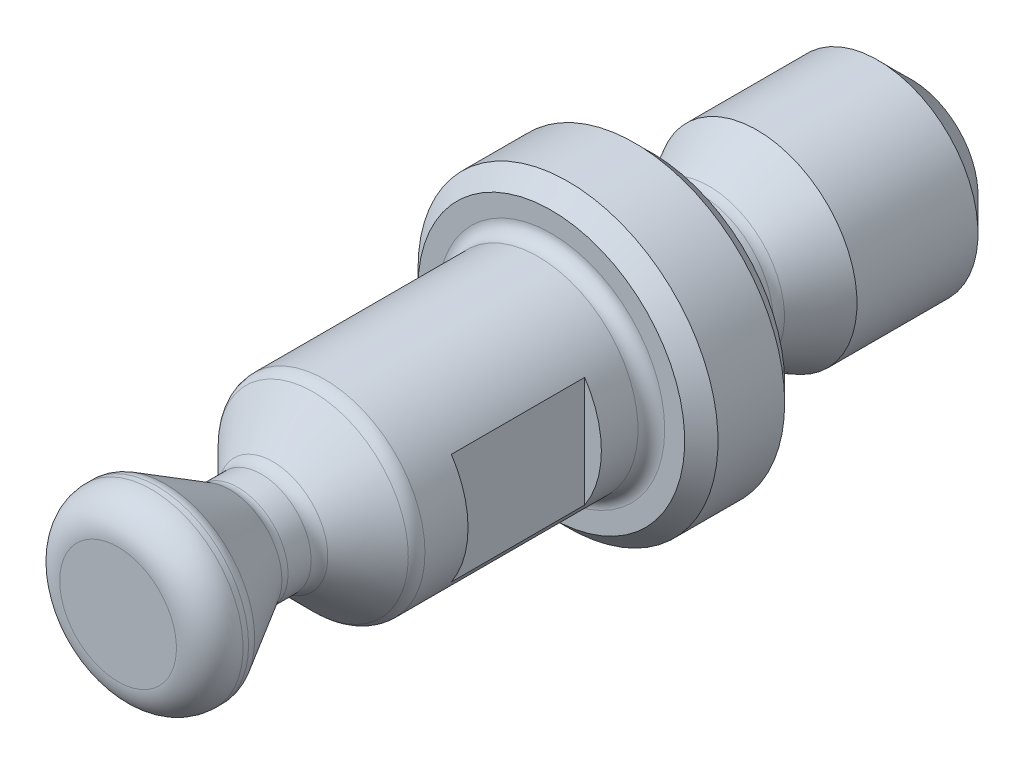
ISO-10303-21;
HEADER;
FILE_DESCRIPTION(('STEP AP214'),'2;1');
FILE_NAME('part.step','',(''),(''),'','','');
FILE_SCHEMA(('AUTOMOTIVE_DESIGN { 1 0 10303 214 1 1 1 1 }'));
ENDSEC;
DATA;
#1=APPLICATION_CONTEXT('core data for automotive mechanical design processes');
#2=APPLICATION_PROTOCOL_DEFINITION('international standard','automotive_design',2000,#1);
#3=PRODUCT_CONTEXT('',#1,'mechanical');
#4=PRODUCT('Part','Part','',(#3));
#5=PRODUCT_RELATED_PRODUCT_CATEGORY('part','',(#4));
#6=PRODUCT_DEFINITION_FORMATION('','',#4);
#7=PRODUCT_DEFINITION_CONTEXT('part definition',#1,'design');
#8=PRODUCT_DEFINITION('design','',#6,#7);
#9=PRODUCT_DEFINITION_SHAPE('','',#8);
#10=(LENGTH_UNIT() NAMED_UNIT(*) SI_UNIT(.MILLI.,.METRE.));
#11=(NAMED_UNIT(*) PLANE_ANGLE_UNIT() SI_UNIT($,.RADIAN.));
#12=(NAMED_UNIT(*) SI_UNIT($,.STERADIAN.) SOLID_ANGLE_UNIT());
#13=UNCERTAINTY_MEASURE_WITH_UNIT(LENGTH_MEASURE(1.E-05),#10,'distance_accuracy_value','');
#14=(GEOMETRIC_REPRESENTATION_CONTEXT(3) GLOBAL_UNCERTAINTY_ASSIGNED_CONTEXT((#13)) GLOBAL_UNIT_ASSIGNED_CONTEXT((#10,
#11,#12)) REPRESENTATION_CONTEXT('',''));
#15=CARTESIAN_POINT('',(0.,0.,0.));
#16=DIRECTION('',(0.,0.,1.));
#17=DIRECTION('',(1.,0.,0.));
#18=AXIS2_PLACEMENT_3D('',#15,#16,#17);
#19=CARTESIAN_POINT('',(0.,0.,-7.8));
#20=DIRECTION('',(0.,0.,1.));
#21=DIRECTION('',(1.,0.,0.));
#22=AXIS2_PLACEMENT_3D('',#19,#20,#21);
#23=PLANE('',#22);
#24=CARTESIAN_POINT('',(0.,0.,-7.8));
#25=DIRECTION('',(0.,0.,-1.));
#26=DIRECTION('',(-1.,0.,0.));
#27=AXIS2_PLACEMENT_3D('',#24,#25,#26);
#28=CIRCLE('',#27,2.);
#29=CARTESIAN_POINT('',(-1.99999999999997,0.,-7.80000000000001));
#30=VERTEX_POINT('',#29);
#31=EDGE_CURVE('E151',#30,#30,#28,.T.);
#32=ORIENTED_EDGE('',*,*,#31,.T.);
#33=EDGE_LOOP('',(#32));
#34=FACE_BOUND('',#33,.T.);
#35=ADVANCED_FACE('F14',(#34),#23,.F.);
#36=CARTESIAN_POINT('',(0.,0.,-6.8));
#37=DIRECTION('',(0.,0.,1.));
#38=DIRECTION('',(1.,0.,0.));
#39=AXIS2_PLACEMENT_3D('',#36,#37,#38);
#40=CONICAL_SURFACE('',#39,3.,0.785398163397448);
#41=ORIENTED_EDGE('',*,*,#31,.F.);
#42=EDGE_LOOP('',(#41));
#43=FACE_BOUND('',#42,.T.);
#44=CARTESIAN_POINT('',(0.,0.,-6.8));
#45=DIRECTION('',(0.,0.,-1.));
#46=DIRECTION('',(-1.,0.,0.));
#47=AXIS2_PLACEMENT_3D('',#44,#45,#46);
#48=CIRCLE('',#47,3.);
#49=CARTESIAN_POINT('',(-2.99999999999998,0.,-6.80000000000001));
#50=VERTEX_POINT('',#49);
#51=EDGE_CURVE('E144',#50,#50,#48,.T.);
#52=ORIENTED_EDGE('',*,*,#51,.T.);
#53=EDGE_LOOP('',(#52));
#54=FACE_BOUND('',#53,.T.);
#55=ADVANCED_FACE('F207',(#43,#54),#40,.T.);
#56=CARTESIAN_POINT('',(1.602589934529E-13,0.,-45.9));
#57=DIRECTION('',(0.,0.,-1.));
#58=DIRECTION('',(-1.,0.,0.));
#59=AXIS2_PLACEMENT_3D('',#56,#57,#58);
#60=CYLINDRICAL_SURFACE('',#59,3.);
#61=ORIENTED_EDGE('',*,*,#51,.F.);
#62=EDGE_LOOP('',(#61));
#63=FACE_BOUND('',#62,.T.);
#64=CARTESIAN_POINT('',(0.,0.,-3.17008840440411));
#65=DIRECTION('',(0.,0.,-1.));
#66=DIRECTION('',(-1.,0.,0.));
#67=AXIS2_PLACEMENT_3D('',#64,#65,#66);
#68=CIRCLE('',#67,3.);
#69=CARTESIAN_POINT('',(-2.99999999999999,0.,-3.17008840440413));
#70=VERTEX_POINT('',#69);
#71=EDGE_CURVE('E141',#70,#70,#68,.T.);
#72=ORIENTED_EDGE('',*,*,#71,.T.);
#73=EDGE_LOOP('',(#72));
#74=FACE_BOUND('',#73,.T.);
#75=ADVANCED_FACE('F213',(#63,#74),#60,.T.);
#76=CARTESIAN_POINT('',(0.,0.,-1.6));
#77=DIRECTION('',(0.,0.,-1.));
#78=DIRECTION('',(-1.,0.,0.));
#79=AXIS2_PLACEMENT_3D('',#76,#77,#78);
#80=CONICAL_SURFACE('',#79,2.2,0.471238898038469);
#81=CARTESIAN_POINT('',(0.,0.,-1.72834704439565));
#82=DIRECTION('',(0.,0.,-1.));
#83=DIRECTION('',(-1.,0.,0.));
#84=AXIS2_PLACEMENT_3D('',#81,#82,#83);
#85=CIRCLE('',#84,2.26539608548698);
#86=CARTESIAN_POINT('',(-2.26539608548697,0.,-1.72834704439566));
#87=VERTEX_POINT('',#86);
#88=EDGE_CURVE('E184',#87,#87,#85,.T.);
#89=ORIENTED_EDGE('',*,*,#88,.T.);
#90=EDGE_LOOP('',(#89));
#91=FACE_BOUND('',#90,.T.);
#92=ORIENTED_EDGE('',*,*,#71,.F.);
#93=EDGE_LOOP('',(#92));
#94=FACE_BOUND('',#93,.T.);
#95=ADVANCED_FACE('F269',(#91,#94),#80,.T.);
#96=CARTESIAN_POINT('',(1.602589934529E-13,0.,-45.9));
#97=DIRECTION('',(0.,0.,-1.));
#98=DIRECTION('',(-1.,0.,0.));
#99=AXIS2_PLACEMENT_3D('',#96,#97,#98);
#100=CYLINDRICAL_SURFACE('',#99,2.2);
#101=CARTESIAN_POINT('',(0.,0.,-1.45595274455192));
#102=DIRECTION('',(0.,0.,-1.));
#103=DIRECTION('',(-1.,0.,0.));
#104=AXIS2_PLACEMENT_3D('',#101,#102,#103);
#105=CIRCLE('',#104,2.2);
#106=CARTESIAN_POINT('',(-2.19999999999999,0.,-1.45595274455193));
#107=VERTEX_POINT('',#106);
#108=EDGE_CURVE('E113',#107,#107,#105,.F.);
#109=ORIENTED_EDGE('',*,*,#108,.T.);
#110=EDGE_LOOP('',(#109));
#111=FACE_BOUND('',#110,.T.);
#112=CARTESIAN_POINT('',(0.,0.,-0.6));
#113=DIRECTION('',(0.,0.,1.));
#114=DIRECTION('',(1.,0.,0.));
#115=AXIS2_PLACEMENT_3D('',#112,#113,#114);
#116=CIRCLE('',#115,2.2);
#117=CARTESIAN_POINT('',(2.2,0.,-0.599999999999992));
#118=VERTEX_POINT('',#117);
#119=EDGE_CURVE('E119',#118,#118,#116,.F.);
#120=ORIENTED_EDGE('',*,*,#119,.T.);
#121=EDGE_LOOP('',(#120));
#122=FACE_BOUND('',#121,.T.);
#123=ADVANCED_FACE('F106',(#111,#122),#100,.T.);
#124=CARTESIAN_POINT('',(0.,2.2,0.));
#125=DIRECTION('',(0.,0.,1.));
#126=DIRECTION('',(1.,0.,0.));
#127=AXIS2_PLACEMENT_3D('',#124,#125,#126);
#128=PLANE('',#127);
#129=CARTESIAN_POINT('',(0.,0.,0.));
#130=DIRECTION('',(0.,0.,1.));
#131=DIRECTION('',(1.,0.,0.));
#132=AXIS2_PLACEMENT_3D('',#129,#130,#131);
#133=CIRCLE('',#132,4.);
#134=CARTESIAN_POINT('',(4.,0.,0.));
#135=VERTEX_POINT('',#134);
#136=EDGE_CURVE('E9',#135,#135,#133,.F.);
#137=ORIENTED_EDGE('',*,*,#136,.T.);
#138=EDGE_LOOP('',(#137));
#139=FACE_BOUND('',#138,.T.);
#140=CARTESIAN_POINT('',(0.,0.,0.));
#141=DIRECTION('',(0.,0.,1.));
#142=DIRECTION('',(1.,0.,0.));
#143=AXIS2_PLACEMENT_3D('',#140,#141,#142);
#144=CIRCLE('',#143,2.8);
#145=CARTESIAN_POINT('',(2.8,0.,0.));
#146=VERTEX_POINT('',#145);
#147=EDGE_CURVE('E110',#146,#146,#144,.T.);
#148=ORIENTED_EDGE('',*,*,#147,.T.);
#149=EDGE_LOOP('',(#148));
#150=FACE_BOUND('',#149,.T.);
#151=ADVANCED_FACE('F96',(#139,#150),#128,.F.);
#152=CARTESIAN_POINT('',(1.602589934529E-13,0.,-45.9));
#153=DIRECTION('',(0.,0.,-1.));
#154=DIRECTION('',(-1.,0.,0.));
#155=AXIS2_PLACEMENT_3D('',#152,#153,#154);
#156=CYLINDRICAL_SURFACE('',#155,4.5);
#157=CARTESIAN_POINT('',(0.,0.,2.5));
#158=DIRECTION('',(0.,0.,-1.));
#159=DIRECTION('',(-1.,0.,0.));
#160=AXIS2_PLACEMENT_3D('',#157,#158,#159);
#161=CIRCLE('',#160,4.5);
#162=CARTESIAN_POINT('',(-4.50000000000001,0.,2.49999999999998));
#163=VERTEX_POINT('',#162);
#164=EDGE_CURVE('E76',#163,#163,#161,.T.);
#165=ORIENTED_EDGE('',*,*,#164,.T.);
#166=EDGE_LOOP('',(#165));
#167=FACE_BOUND('',#166,.T.);
#168=CARTESIAN_POINT('',(0.,0.,0.500000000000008));
#169=DIRECTION('',(0.,0.,1.));
#170=DIRECTION('',(1.,0.,0.));
#171=AXIS2_PLACEMENT_3D('',#168,#169,#170);
#172=CIRCLE('',#171,4.5);
#173=CARTESIAN_POINT('',(4.5,0.,0.500000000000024));
#174=VERTEX_POINT('',#173);
#175=EDGE_CURVE('E73',#174,#174,#172,.T.);
#176=ORIENTED_EDGE('',*,*,#175,.T.);
#177=EDGE_LOOP('',(#176));
#178=FACE_BOUND('',#177,.T.);
#179=ADVANCED_FACE('F93',(#167,#178),#156,.T.);
#180=CARTESIAN_POINT('',(0.,4.5,3.));
#181=DIRECTION('',(0.,0.,-1.));
#182=DIRECTION('',(-1.,0.,0.));
#183=AXIS2_PLACEMENT_3D('',#180,#181,#182);
#184=PLANE('',#183);
#185=CARTESIAN_POINT('',(0.,0.,3.));
#186=DIRECTION('',(0.,0.,-1.));
#187=DIRECTION('',(-1.,0.,0.));
#188=AXIS2_PLACEMENT_3D('',#185,#186,#187);
#189=CIRCLE('',#188,4.);
#190=CARTESIAN_POINT('',(-4.00000000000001,0.,2.99999999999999));
#191=VERTEX_POINT('',#190);
#192=EDGE_CURVE('E22',#191,#191,#189,.F.);
#193=ORIENTED_EDGE('',*,*,#192,.T.);
#194=EDGE_LOOP('',(#193));
#195=FACE_BOUND('',#194,.T.);
#196=CARTESIAN_POINT('',(0.,0.,3.));
#197=DIRECTION('',(0.,0.,-1.));
#198=DIRECTION('',(-1.,0.,0.));
#199=AXIS2_PLACEMENT_3D('',#196,#197,#198);
#200=CIRCLE('',#199,3.4);
#201=CARTESIAN_POINT('',(-3.40000000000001,0.,2.99999999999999));
#202=VERTEX_POINT('',#201);
#203=EDGE_CURVE('E112',#202,#202,#200,.T.);
#204=ORIENTED_EDGE('',*,*,#203,.T.);
#205=EDGE_LOOP('',(#204));
#206=FACE_BOUND('',#205,.T.);
#207=ADVANCED_FACE('F85',(#195,#206),#184,.F.);
#208=CARTESIAN_POINT('',(1.602589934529E-13,0.,-45.9));
#209=DIRECTION('',(0.,0.,-1.));
#210=DIRECTION('',(-1.,0.,0.));
#211=AXIS2_PLACEMENT_3D('',#208,#209,#210);
#212=CYLINDRICAL_SURFACE('',#211,3.);
#213=DIRECTION('',(0.,0.,-1.));
#214=VECTOR('',#213,1.);
#215=CARTESIAN_POINT('',(-2.49999999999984,1.6583123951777,-45.9));
#216=LINE('',#215,#214);
#217=CARTESIAN_POINT('',(-2.5,1.6583123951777,4.5));
#218=VERTEX_POINT('',#217);
#219=CARTESIAN_POINT('',(-2.5,1.6583123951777,8.5));
#220=VERTEX_POINT('',#219);
#221=EDGE_CURVE('E66',#218,#220,#216,.F.);
#222=ORIENTED_EDGE('',*,*,#221,.T.);
#223=CARTESIAN_POINT('',(0.,0.,8.5));
#224=DIRECTION('',(0.,0.,1.));
#225=DIRECTION('',(1.,0.,0.));
#226=AXIS2_PLACEMENT_3D('',#223,#224,#225);
#227=CIRCLE('',#226,3.);
#228=CARTESIAN_POINT('',(-2.5,-1.6583123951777,8.5));
#229=VERTEX_POINT('',#228);
#230=EDGE_CURVE('E54',#220,#229,#227,.T.);
#231=ORIENTED_EDGE('',*,*,#230,.T.);
#232=DIRECTION('',(0.,0.,-1.));
#233=VECTOR('',#232,1.);
#234=CARTESIAN_POINT('',(-2.49999999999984,-1.6583123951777,-45.9));
#235=LINE('',#234,#233);
#236=CARTESIAN_POINT('',(-2.5,-1.6583123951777,4.5));
#237=VERTEX_POINT('',#236);
#238=EDGE_CURVE('E59',#229,#237,#235,.T.);
#239=ORIENTED_EDGE('',*,*,#238,.T.);
#240=CARTESIAN_POINT('',(0.,0.,4.5));
#241=DIRECTION('',(0.,0.,-1.));
#242=DIRECTION('',(-1.,0.,0.));
#243=AXIS2_PLACEMENT_3D('',#240,#241,#242);
#244=CIRCLE('',#243,3.);
#245=EDGE_CURVE('E72',#237,#218,#244,.T.);
#246=ORIENTED_EDGE('',*,*,#245,.T.);
#247=EDGE_LOOP('',(#222,#231,#239,#246));
#248=FACE_BOUND('',#247,.T.);
#249=CARTESIAN_POINT('',(0.,0.,8.5));
#250=DIRECTION('',(0.,0.,1.));
#251=DIRECTION('',(1.,0.,0.));
#252=AXIS2_PLACEMENT_3D('',#249,#250,#251);
#253=CIRCLE('',#252,3.);
#254=CARTESIAN_POINT('',(2.49999999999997,-1.6583123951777,8.5));
#255=VERTEX_POINT('',#254);
#256=CARTESIAN_POINT('',(2.49999999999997,1.6583123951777,8.5));
#257=VERTEX_POINT('',#256);
#258=EDGE_CURVE('E128',#255,#257,#253,.T.);
#259=ORIENTED_EDGE('',*,*,#258,.T.);
#260=DIRECTION('',(0.,0.,-1.));
#261=VECTOR('',#260,1.);
#262=CARTESIAN_POINT('',(2.50000000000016,1.6583123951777,-45.9));
#263=LINE('',#262,#261);
#264=CARTESIAN_POINT('',(2.5,1.6583123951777,4.5));
#265=VERTEX_POINT('',#264);
#266=EDGE_CURVE('E60',#257,#265,#263,.T.);
#267=ORIENTED_EDGE('',*,*,#266,.T.);
#268=CARTESIAN_POINT('',(0.,0.,4.5));
#269=DIRECTION('',(0.,0.,-1.));
#270=DIRECTION('',(-1.,0.,0.));
#271=AXIS2_PLACEMENT_3D('',#268,#269,#270);
#272=CIRCLE('',#271,3.);
#273=CARTESIAN_POINT('',(2.5,-1.6583123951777,4.5));
#274=VERTEX_POINT('',#273);
#275=EDGE_CURVE('E130',#265,#274,#272,.T.);
#276=ORIENTED_EDGE('',*,*,#275,.T.);
#277=DIRECTION('',(0.,0.,-1.));
#278=VECTOR('',#277,1.);
#279=CARTESIAN_POINT('',(2.50000000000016,-1.6583123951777,-45.9));
#280=LINE('',#279,#278);
#281=EDGE_CURVE('E125',#274,#255,#280,.F.);
#282=ORIENTED_EDGE('',*,*,#281,.T.);
#283=EDGE_LOOP('',(#259,#267,#276,#282));
#284=FACE_BOUND('',#283,.T.);
#285=CARTESIAN_POINT('',(0.,0.,3.4));
#286=DIRECTION('',(0.,0.,-1.));
#287=DIRECTION('',(-1.,0.,0.));
#288=AXIS2_PLACEMENT_3D('',#285,#286,#287);
#289=CIRCLE('',#288,3.);
#290=CARTESIAN_POINT('',(-3.00000000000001,0.,3.39999999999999));
#291=VERTEX_POINT('',#290);
#292=EDGE_CURVE('E116',#291,#291,#289,.F.);
#293=ORIENTED_EDGE('',*,*,#292,.T.);
#294=EDGE_LOOP('',(#293));
#295=FACE_BOUND('',#294,.T.);
#296=CARTESIAN_POINT('',(0.,0.,9.79289321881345));
#297=DIRECTION('',(0.,0.,1.));
#298=DIRECTION('',(1.,0.,0.));
#299=AXIS2_PLACEMENT_3D('',#296,#297,#298);
#300=CIRCLE('',#299,3.);
#301=CARTESIAN_POINT('',(2.99999999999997,0.,9.79289321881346));
#302=VERTEX_POINT('',#301);
#303=EDGE_CURVE('E160',#302,#302,#300,.F.);
#304=ORIENTED_EDGE('',*,*,#303,.T.);
#305=EDGE_LOOP('',(#304));
#306=FACE_BOUND('',#305,.T.);
#307=ADVANCED_FACE('F70',(#248,#284,#295,#306),#212,.T.);
#308=CARTESIAN_POINT('',(0.,0.,11.5));
#309=DIRECTION('',(0.,0.,-1.));
#310=DIRECTION('',(-1.,0.,0.));
#311=AXIS2_PLACEMENT_3D('',#308,#309,#310);
#312=CONICAL_SURFACE('',#311,1.5,0.78539816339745);
#313=CARTESIAN_POINT('',(0.,0.,10.1464466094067));
#314=DIRECTION('',(0.,0.,1.));
#315=DIRECTION('',(1.,0.,0.));
#316=AXIS2_PLACEMENT_3D('',#313,#314,#315);
#317=CIRCLE('',#316,2.85355339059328);
#318=CARTESIAN_POINT('',(2.85355339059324,0.,10.1464466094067));
#319=VERTEX_POINT('',#318);
#320=EDGE_CURVE('E166',#319,#319,#317,.T.);
#321=ORIENTED_EDGE('',*,*,#320,.T.);
#322=EDGE_LOOP('',(#321));
#323=FACE_BOUND('',#322,.T.);
#324=CARTESIAN_POINT('',(0.,0.,11.3535533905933));
#325=DIRECTION('',(0.,0.,-1.));
#326=DIRECTION('',(-1.,0.,0.));
#327=AXIS2_PLACEMENT_3D('',#324,#325,#326);
#328=CIRCLE('',#327,1.64644660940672);
#329=CARTESIAN_POINT('',(-1.64644660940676,0.,11.3535533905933));
#330=VERTEX_POINT('',#329);
#331=EDGE_CURVE('E163',#330,#330,#328,.T.);
#332=ORIENTED_EDGE('',*,*,#331,.T.);
#333=EDGE_LOOP('',(#332));
#334=FACE_BOUND('',#333,.T.);
#335=ADVANCED_FACE('F255',(#323,#334),#312,.T.);
#336=CARTESIAN_POINT('',(1.602589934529E-13,0.,-45.9));
#337=DIRECTION('',(0.,0.,-1.));
#338=DIRECTION('',(-1.,0.,0.));
#339=AXIS2_PLACEMENT_3D('',#336,#337,#338);
#340=CYLINDRICAL_SURFACE('',#339,1.5);
#341=CARTESIAN_POINT('',(0.,0.,11.7071067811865));
#342=DIRECTION('',(0.,0.,-1.));
#343=DIRECTION('',(-1.,0.,0.));
#344=AXIS2_PLACEMENT_3D('',#341,#342,#343);
#345=CIRCLE('',#344,1.5);
#346=CARTESIAN_POINT('',(-1.50000000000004,0.,11.7071067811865));
#347=VERTEX_POINT('',#346);
#348=EDGE_CURVE('E172',#347,#347,#345,.F.);
#349=ORIENTED_EDGE('',*,*,#348,.T.);
#350=EDGE_LOOP('',(#349));
#351=FACE_BOUND('',#350,.T.);
#352=CARTESIAN_POINT('',(0.,0.,12.4009618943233));
#353=DIRECTION('',(0.,0.,-1.));
#354=DIRECTION('',(-1.,0.,0.));
#355=AXIS2_PLACEMENT_3D('',#352,#353,#354);
#356=CIRCLE('',#355,1.5);
#357=CARTESIAN_POINT('',(-1.50000000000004,0.,12.4009618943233));
#358=VERTEX_POINT('',#357);
#359=EDGE_CURVE('E169',#358,#358,#356,.T.);
#360=ORIENTED_EDGE('',*,*,#359,.T.);
#361=EDGE_LOOP('',(#360));
#362=FACE_BOUND('',#361,.T.);
#363=ADVANCED_FACE('F246',(#351,#362),#340,.T.);
#364=CARTESIAN_POINT('',(0.,0.,14.7));
#365=DIRECTION('',(0.,0.,1.));
#366=DIRECTION('',(1.,0.,0.));
#367=AXIS2_PLACEMENT_3D('',#364,#365,#366);
#368=CONICAL_SURFACE('',#367,2.75,0.523598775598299);
#369=CARTESIAN_POINT('',(0.,0.,12.6509618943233));
#370=DIRECTION('',(0.,0.,1.));
#371=DIRECTION('',(1.,0.,0.));
#372=AXIS2_PLACEMENT_3D('',#369,#370,#371);
#373=CIRCLE('',#372,1.56698729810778);
#374=CARTESIAN_POINT('',(1.56698729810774,0.,12.6509618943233));
#375=VERTEX_POINT('',#374);
#376=EDGE_CURVE('E178',#375,#375,#373,.T.);
#377=ORIENTED_EDGE('',*,*,#376,.T.);
#378=EDGE_LOOP('',(#377));
#379=FACE_BOUND('',#378,.T.);
#380=CARTESIAN_POINT('',(0.,0.,14.5839745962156));
#381=DIRECTION('',(0.,0.,-1.));
#382=DIRECTION('',(-1.,0.,0.));
#383=AXIS2_PLACEMENT_3D('',#380,#381,#382);
#384=CIRCLE('',#383,2.68301270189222);
#385=CARTESIAN_POINT('',(-2.68301270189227,0.,14.5839745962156));
#386=VERTEX_POINT('',#385);
#387=EDGE_CURVE('E175',#386,#386,#384,.T.);
#388=ORIENTED_EDGE('',*,*,#387,.T.);
#389=EDGE_LOOP('',(#388));
#390=FACE_BOUND('',#389,.T.);
#391=ADVANCED_FACE('F243',(#379,#390),#368,.T.);
#392=CARTESIAN_POINT('',(1.602589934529E-13,0.,-45.9));
#393=DIRECTION('',(0.,0.,-1.));
#394=DIRECTION('',(-1.,0.,0.));
#395=AXIS2_PLACEMENT_3D('',#392,#393,#394);
#396=CYLINDRICAL_SURFACE('',#395,2.75);
#397=CARTESIAN_POINT('',(0.,0.,14.8339745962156));
#398=DIRECTION('',(0.,0.,1.));
#399=DIRECTION('',(1.,0.,0.));
#400=AXIS2_PLACEMENT_3D('',#397,#398,#399);
#401=CIRCLE('',#400,2.75);
#402=CARTESIAN_POINT('',(2.74999999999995,0.,14.8339745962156));
#403=VERTEX_POINT('',#402);
#404=EDGE_CURVE('E181',#403,#403,#401,.T.);
#405=ORIENTED_EDGE('',*,*,#404,.T.);
#406=EDGE_LOOP('',(#405));
#407=FACE_BOUND('',#406,.T.);
#408=CARTESIAN_POINT('',(0.,0.,15.));
#409=DIRECTION('',(0.,0.,-1.));
#410=DIRECTION('',(-1.,0.,0.));
#411=AXIS2_PLACEMENT_3D('',#408,#409,#410);
#412=CIRCLE('',#411,2.75);
#413=CARTESIAN_POINT('',(-2.75000000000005,0.,15.));
#414=VERTEX_POINT('',#413);
#415=EDGE_CURVE('E154',#414,#414,#412,.T.);
#416=ORIENTED_EDGE('',*,*,#415,.T.);
#417=EDGE_LOOP('',(#416));
#418=FACE_BOUND('',#417,.T.);
#419=ADVANCED_FACE('F245',(#407,#418),#396,.T.);
#420=CARTESIAN_POINT('',(0.,2.75,16.));
#421=DIRECTION('',(0.,0.,-1.));
#422=DIRECTION('',(-1.,0.,0.));
#423=AXIS2_PLACEMENT_3D('',#420,#421,#422);
#424=PLANE('',#423);
#425=CARTESIAN_POINT('',(0.,0.,16.));
#426=DIRECTION('',(0.,0.,-1.));
#427=DIRECTION('',(-1.,0.,0.));
#428=AXIS2_PLACEMENT_3D('',#425,#426,#427);
#429=CIRCLE('',#428,1.75);
#430=CARTESIAN_POINT('',(-1.75000000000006,0.,16.));
#431=VERTEX_POINT('',#430);
#432=EDGE_CURVE('E157',#431,#431,#429,.F.);
#433=ORIENTED_EDGE('',*,*,#432,.T.);
#434=EDGE_LOOP('',(#433));
#435=FACE_BOUND('',#434,.T.);
#436=ADVANCED_FACE('F222',(#435),#424,.F.);
#437=CARTESIAN_POINT('',(0.,0.,15.));
#438=DIRECTION('',(0.,0.,-1.));
#439=DIRECTION('',(-1.,0.,0.));
#440=AXIS2_PLACEMENT_3D('',#437,#438,#439);
#441=TOROIDAL_SURFACE('',#440,1.75,1.);
#442=ORIENTED_EDGE('',*,*,#432,.F.);
#443=EDGE_LOOP('',(#442));
#444=FACE_BOUND('',#443,.T.);
#445=ORIENTED_EDGE('',*,*,#415,.F.);
#446=EDGE_LOOP('',(#445));
#447=FACE_BOUND('',#446,.T.);
#448=ADVANCED_FACE('F218',(#444,#447),#441,.T.);
#449=CARTESIAN_POINT('',(0.,0.,9.79289321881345));
#450=DIRECTION('',(0.,0.,1.));
#451=DIRECTION('',(1.,0.,0.));
#452=AXIS2_PLACEMENT_3D('',#449,#450,#451);
#453=TOROIDAL_SURFACE('',#452,2.5,0.5);
#454=ORIENTED_EDGE('',*,*,#320,.F.);
#455=EDGE_LOOP('',(#454));
#456=FACE_BOUND('',#455,.T.);
#457=ORIENTED_EDGE('',*,*,#303,.F.);
#458=EDGE_LOOP('',(#457));
#459=FACE_BOUND('',#458,.T.);
#460=ADVANCED_FACE('F221',(#456,#459),#453,.T.);
#461=CARTESIAN_POINT('',(0.,0.,11.7071067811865));
#462=DIRECTION('',(0.,0.,-1.));
#463=DIRECTION('',(-1.,0.,0.));
#464=AXIS2_PLACEMENT_3D('',#461,#462,#463);
#465=TOROIDAL_SURFACE('',#464,2.,0.5);
#466=ORIENTED_EDGE('',*,*,#348,.F.);
#467=EDGE_LOOP('',(#466));
#468=FACE_BOUND('',#467,.T.);
#469=ORIENTED_EDGE('',*,*,#331,.F.);
#470=EDGE_LOOP('',(#469));
#471=FACE_BOUND('',#470,.T.);
#472=ADVANCED_FACE('F226',(#468,#471),#465,.F.);
#473=CARTESIAN_POINT('',(0.,0.,12.4009618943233));
#474=DIRECTION('',(0.,0.,-1.));
#475=DIRECTION('',(-1.,0.,0.));
#476=AXIS2_PLACEMENT_3D('',#473,#474,#475);
#477=TOROIDAL_SURFACE('',#476,2.,0.5);
#478=ORIENTED_EDGE('',*,*,#376,.F.);
#479=EDGE_LOOP('',(#478));
#480=FACE_BOUND('',#479,.T.);
#481=ORIENTED_EDGE('',*,*,#359,.F.);
#482=EDGE_LOOP('',(#481));
#483=FACE_BOUND('',#482,.T.);
#484=ADVANCED_FACE('F230',(#480,#483),#477,.F.);
#485=CARTESIAN_POINT('',(0.,0.,14.8339745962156));
#486=DIRECTION('',(0.,0.,1.));
#487=DIRECTION('',(1.,0.,0.));
#488=AXIS2_PLACEMENT_3D('',#485,#486,#487);
#489=TOROIDAL_SURFACE('',#488,2.25,0.5);
#490=ORIENTED_EDGE('',*,*,#404,.F.);
#491=EDGE_LOOP('',(#490));
#492=FACE_BOUND('',#491,.T.);
#493=ORIENTED_EDGE('',*,*,#387,.F.);
#494=EDGE_LOOP('',(#493));
#495=FACE_BOUND('',#494,.T.);
#496=ADVANCED_FACE('F203',(#492,#495),#489,.T.);
#497=CARTESIAN_POINT('',(0.,0.,-1.45595274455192));
#498=DIRECTION('',(0.,0.,-1.));
#499=DIRECTION('',(-1.,0.,0.));
#500=AXIS2_PLACEMENT_3D('',#497,#498,#499);
#501=TOROIDAL_SURFACE('',#500,2.8,0.6);
#502=ORIENTED_EDGE('',*,*,#108,.F.);
#503=EDGE_LOOP('',(#502));
#504=FACE_BOUND('',#503,.T.);
#505=ORIENTED_EDGE('',*,*,#88,.F.);
#506=EDGE_LOOP('',(#505));
#507=FACE_BOUND('',#506,.T.);
#508=ADVANCED_FACE('F193',(#504,#507),#501,.F.);
#509=CARTESIAN_POINT('',(0.,0.,-0.6));
#510=DIRECTION('',(0.,0.,1.));
#511=DIRECTION('',(1.,0.,0.));
#512=AXIS2_PLACEMENT_3D('',#509,#510,#511);
#513=TOROIDAL_SURFACE('',#512,2.8,0.6);
#514=ORIENTED_EDGE('',*,*,#147,.F.);
#515=EDGE_LOOP('',(#514));
#516=FACE_BOUND('',#515,.T.);
#517=ORIENTED_EDGE('',*,*,#119,.F.);
#518=EDGE_LOOP('',(#517));
#519=FACE_BOUND('',#518,.T.);
#520=ADVANCED_FACE('F190',(#516,#519),#513,.F.);
#521=CARTESIAN_POINT('',(0.,0.,3.4));
#522=DIRECTION('',(0.,0.,-1.));
#523=DIRECTION('',(-1.,0.,0.));
#524=AXIS2_PLACEMENT_3D('',#521,#522,#523);
#525=TOROIDAL_SURFACE('',#524,3.4,0.4);
#526=ORIENTED_EDGE('',*,*,#292,.F.);
#527=EDGE_LOOP('',(#526));
#528=FACE_BOUND('',#527,.T.);
#529=ORIENTED_EDGE('',*,*,#203,.F.);
#530=EDGE_LOOP('',(#529));
#531=FACE_BOUND('',#530,.T.);
#532=ADVANCED_FACE('F192',(#528,#531),#525,.F.);
#533=CARTESIAN_POINT('',(2.5,-4.5,4.5));
#534=DIRECTION('',(0.,0.,-1.));
#535=DIRECTION('',(-1.,0.,0.));
#536=AXIS2_PLACEMENT_3D('',#533,#534,#535);
#537=PLANE('',#536);
#538=DIRECTION('',(0.,1.,0.));
#539=VECTOR('',#538,1.);
#540=CARTESIAN_POINT('',(2.5,-4.5,4.5));
#541=LINE('',#540,#539);
#542=EDGE_CURVE('E138',#274,#265,#541,.T.);
#543=ORIENTED_EDGE('',*,*,#542,.F.);
#544=ORIENTED_EDGE('',*,*,#275,.F.);
#545=EDGE_LOOP('',(#543,#544));
#546=FACE_BOUND('',#545,.T.);
#547=ADVANCED_FACE('F200',(#546),#537,.F.);
#548=CARTESIAN_POINT('',(2.49999999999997,-4.5,8.5));
#549=DIRECTION('',(0.,0.,1.));
#550=DIRECTION('',(1.,0.,0.));
#551=AXIS2_PLACEMENT_3D('',#548,#549,#550);
#552=PLANE('',#551);
#553=ORIENTED_EDGE('',*,*,#258,.F.);
#554=DIRECTION('',(0.,1.,0.));
#555=VECTOR('',#554,1.);
#556=CARTESIAN_POINT('',(2.49999999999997,-4.5,8.5));
#557=LINE('',#556,#555);
#558=EDGE_CURVE('E36',#255,#257,#557,.T.);
#559=ORIENTED_EDGE('',*,*,#558,.T.);
#560=EDGE_LOOP('',(#553,#559));
#561=FACE_BOUND('',#560,.T.);
#562=ADVANCED_FACE('F140',(#561),#552,.F.);
#563=CARTESIAN_POINT('',(2.5,-4.5,4.5));
#564=DIRECTION('',(-1.,0.,0.));
#565=DIRECTION('',(0.,0.,1.));
#566=AXIS2_PLACEMENT_3D('',#563,#564,#565);
#567=PLANE('',#566);
#568=ORIENTED_EDGE('',*,*,#558,.F.);
#569=ORIENTED_EDGE('',*,*,#281,.F.);
#570=ORIENTED_EDGE('',*,*,#542,.T.);
#571=ORIENTED_EDGE('',*,*,#266,.F.);
#572=EDGE_LOOP('',(#568,#569,#570,#571));
#573=FACE_BOUND('',#572,.T.);
#574=ADVANCED_FACE('F136',(#573),#567,.F.);
#575=CARTESIAN_POINT('',(-2.5,-4.5,4.5));
#576=DIRECTION('',(0.,0.,-1.));
#577=DIRECTION('',(-1.,0.,0.));
#578=AXIS2_PLACEMENT_3D('',#575,#576,#577);
#579=PLANE('',#578);
#580=ORIENTED_EDGE('',*,*,#245,.F.);
#581=DIRECTION('',(0.,1.,0.));
#582=VECTOR('',#581,1.);
#583=CARTESIAN_POINT('',(-2.5,-4.5,4.5));
#584=LINE('',#583,#582);
#585=EDGE_CURVE('E68',#237,#218,#584,.T.);
#586=ORIENTED_EDGE('',*,*,#585,.T.);
#587=EDGE_LOOP('',(#580,#586));
#588=FACE_BOUND('',#587,.T.);
#589=ADVANCED_FACE('F422',(#588),#579,.F.);
#590=CARTESIAN_POINT('',(-2.5,-4.5,4.5));
#591=DIRECTION('',(1.,0.,0.));
#592=DIRECTION('',(0.,0.,-1.));
#593=AXIS2_PLACEMENT_3D('',#590,#591,#592);
#594=PLANE('',#593);
#595=DIRECTION('',(0.,1.,0.));
#596=VECTOR('',#595,1.);
#597=CARTESIAN_POINT('',(-2.5,-4.5,8.5));
#598=LINE('',#597,#596);
#599=EDGE_CURVE('E28',#229,#220,#598,.T.);
#600=ORIENTED_EDGE('',*,*,#599,.T.);
#601=ORIENTED_EDGE('',*,*,#221,.F.);
#602=ORIENTED_EDGE('',*,*,#585,.F.);
#603=ORIENTED_EDGE('',*,*,#238,.F.);
#604=EDGE_LOOP('',(#600,#601,#602,#603));
#605=FACE_BOUND('',#604,.T.);
#606=ADVANCED_FACE('F64',(#605),#594,.F.);
#607=CARTESIAN_POINT('',(-2.5,-4.5,8.5));
#608=DIRECTION('',(0.,0.,1.));
#609=DIRECTION('',(1.,0.,0.));
#610=AXIS2_PLACEMENT_3D('',#607,#608,#609);
#611=PLANE('',#610);
#612=ORIENTED_EDGE('',*,*,#599,.F.);
#613=ORIENTED_EDGE('',*,*,#230,.F.);
#614=EDGE_LOOP('',(#612,#613));
#615=FACE_BOUND('',#614,.T.);
#616=ADVANCED_FACE('F55',(#615),#611,.F.);
#617=CARTESIAN_POINT('',(0.,0.,2.5));
#618=DIRECTION('',(0.,0.,-1.));
#619=DIRECTION('',(-1.,0.,0.));
#620=AXIS2_PLACEMENT_3D('',#617,#618,#619);
#621=CONICAL_SURFACE('',#620,4.5,0.78539816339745);
#622=ORIENTED_EDGE('',*,*,#192,.F.);
#623=EDGE_LOOP('',(#622));
#624=FACE_BOUND('',#623,.T.);
#625=ORIENTED_EDGE('',*,*,#164,.F.);
#626=EDGE_LOOP('',(#625));
#627=FACE_BOUND('',#626,.T.);
#628=ADVANCED_FACE('F88',(#624,#627),#621,.T.);
#629=CARTESIAN_POINT('',(0.,0.,0.));
#630=DIRECTION('',(0.,0.,1.));
#631=DIRECTION('',(1.,0.,0.));
#632=AXIS2_PLACEMENT_3D('',#629,#630,#631);
#633=CONICAL_SURFACE('',#632,4.,0.785398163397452);
#634=ORIENTED_EDGE('',*,*,#175,.F.);
#635=EDGE_LOOP('',(#634));
#636=FACE_BOUND('',#635,.T.);
#637=ORIENTED_EDGE('',*,*,#136,.F.);
#638=EDGE_LOOP('',(#637));
#639=FACE_BOUND('',#638,.T.);
#640=ADVANCED_FACE('F16',(#636,#639),#633,.T.);
#641=CLOSED_SHELL('',(#35,#55,#75,#95,#123,#151,#179,#207,#307,#335,#363,#391,#419,#436,#448,
#460,#472,#484,#496,#508,#520,#532,#547,#562,#574,#589,#606,#616,#628,#640));
#642=MANIFOLD_SOLID_BREP('B1',#641);
#643=ADVANCED_BREP_SHAPE_REPRESENTATION('',(#18,#642),#14);
#644=SHAPE_DEFINITION_REPRESENTATION(#9,#643);
ENDSEC;
END-ISO-10303-21;
